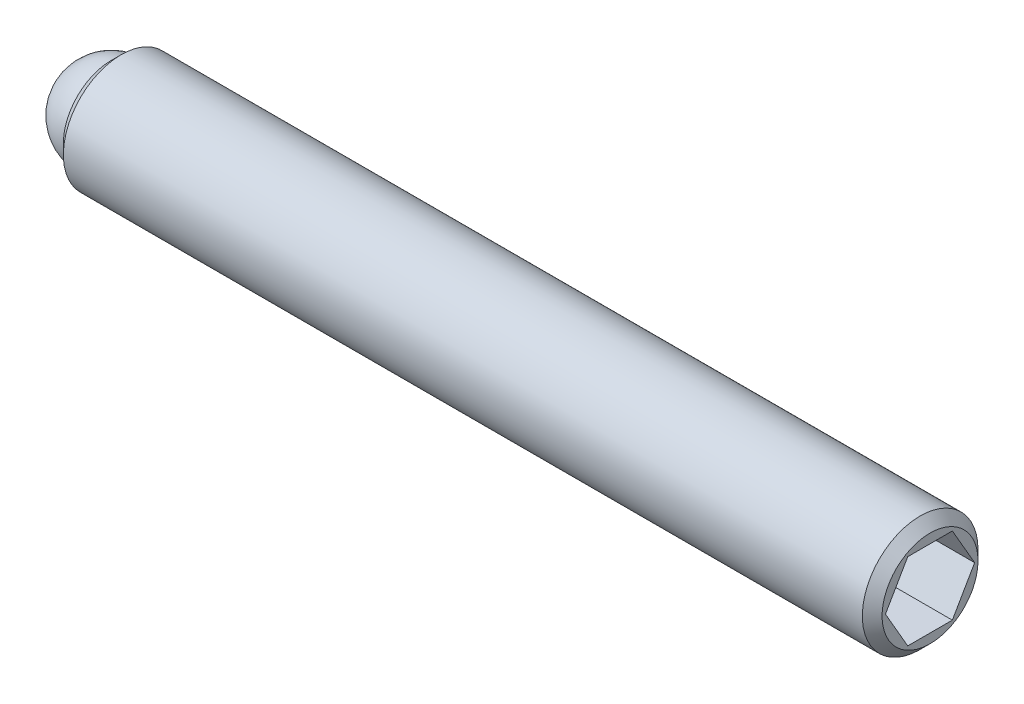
from build123d import *

# Parameters (mm, degrees)
SKETCH2_R           = 1.4859
BOSS_EXTRUDE1_DEPTH = 21.034375
CHAMFER1_SIZE       = 0.254
CHAMFER2_SIZE       = 0.254
CUT_EXTRUDE2_DEPTH  = 2.286
SKETCH3_R           = 1.190625
CUT_EXTRUDE3_DEPTH  = 1.190625


with BuildPart() as part:
    # Sketch2 → Boss-Extrude1 (new body)
    with BuildSketch(Plane(origin=(0, 0, 0), x_dir=(0, 0, -1), z_dir=(1, 0, 0))):
        Circle(SKETCH2_R)
    extrude(amount=BOSS_EXTRUDE1_DEPTH)

    # Chamfer1
    chamfer1_edges = [part.edges().sort_by_distance(p)[0] for p in [
        (0, 0, 1.4859),
    ]]
    chamfer(chamfer1_edges, length=CHAMFER1_SIZE)

    # Chamfer2
    chamfer2_edges = [part.edges().sort_by_distance(p)[0] for p in [
        (21.034375, 0, 1.4859),
    ]]
    chamfer(chamfer2_edges, length=CHAMFER2_SIZE)

    # Sketch4 → Cut-Extrude2 (cut)
    with BuildSketch(Plane(origin=(21.034375, 0, 0), x_dir=(0, 0, -1), z_dir=(1, 0, 0))):
        Polygon((1.14567944, 0), (0.57283972, 0.9921875), (-0.57283972, 0.9921875), (-1.14567944, 0), (-0.57283972, -0.9921875), (0.57283972, -0.9921875), align=None)
    extrude(amount=-CUT_EXTRUDE2_DEPTH, mode=Mode.SUBTRACT)

    # Sketch3 → Cut-Extrude3 (cut)
    with BuildSketch(Plane.ZY):
        Circle(SKETCH3_R)
    extrude(amount=-CUT_EXTRUDE3_DEPTH, mode=Mode.SUBTRACT)


with BuildPart() as body_2:
    # Sketch5 → Revolve1 (revolve)
    with BuildSketch(Plane.ZY):
        with BuildLine():
            Line((0, 0), (0, -1.190625))
            ThreePointArc((0, -1.190625), (-1.190625, 0), (0, 1.190625))
            Line((0, 1.190625), (0, 0))
        make_face()
    revolve(axis=Axis((0, 0, 0), (0, 1, 0)))


solid = Compound([part.part, body_2.part])
